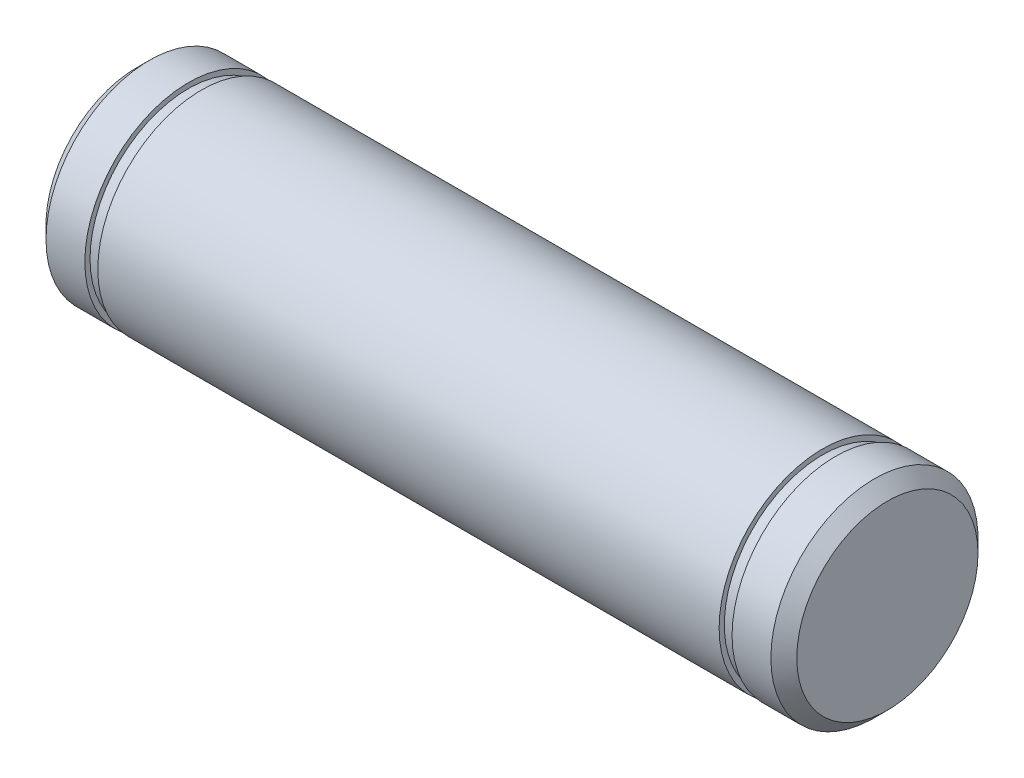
ISO-10303-21;
HEADER;
FILE_DESCRIPTION(('STEP AP214'),'2;1');
FILE_NAME('part.step','',(''),(''),'','','');
FILE_SCHEMA(('AUTOMOTIVE_DESIGN { 1 0 10303 214 1 1 1 1 }'));
ENDSEC;
DATA;
#1=APPLICATION_CONTEXT('core data for automotive mechanical design processes');
#2=APPLICATION_PROTOCOL_DEFINITION('international standard','automotive_design',2000,#1);
#3=PRODUCT_CONTEXT('',#1,'mechanical');
#4=PRODUCT('Part','Part','',(#3));
#5=PRODUCT_RELATED_PRODUCT_CATEGORY('part','',(#4));
#6=PRODUCT_DEFINITION_FORMATION('','',#4);
#7=PRODUCT_DEFINITION_CONTEXT('part definition',#1,'design');
#8=PRODUCT_DEFINITION('design','',#6,#7);
#9=PRODUCT_DEFINITION_SHAPE('','',#8);
#10=(LENGTH_UNIT() NAMED_UNIT(*) SI_UNIT(.MILLI.,.METRE.));
#11=(NAMED_UNIT(*) PLANE_ANGLE_UNIT() SI_UNIT($,.RADIAN.));
#12=(NAMED_UNIT(*) SI_UNIT($,.STERADIAN.) SOLID_ANGLE_UNIT());
#13=UNCERTAINTY_MEASURE_WITH_UNIT(LENGTH_MEASURE(1.E-05),#10,'distance_accuracy_value','');
#14=(GEOMETRIC_REPRESENTATION_CONTEXT(3) GLOBAL_UNCERTAINTY_ASSIGNED_CONTEXT((#13)) GLOBAL_UNIT_ASSIGNED_CONTEXT((#10,
#11,#12)) REPRESENTATION_CONTEXT('',''));
#15=CARTESIAN_POINT('',(0.,0.,0.));
#16=DIRECTION('',(0.,0.,1.));
#17=DIRECTION('',(1.,0.,0.));
#18=AXIS2_PLACEMENT_3D('',#15,#16,#17);
#19=CARTESIAN_POINT('',(14.5,0.,0.));
#20=DIRECTION('',(-1.,0.,0.));
#21=DIRECTION('',(0.,0.,1.));
#22=AXIS2_PLACEMENT_3D('',#19,#20,#21);
#23=CYLINDRICAL_SURFACE('',#22,2.);
#24=CARTESIAN_POINT('',(13.25,0.,0.));
#25=DIRECTION('',(1.,0.,0.));
#26=DIRECTION('',(0.,0.,-1.));
#27=AXIS2_PLACEMENT_3D('',#24,#25,#26);
#28=CIRCLE('',#27,2.);
#29=CARTESIAN_POINT('',(13.25,0.,2.));
#30=VERTEX_POINT('',#29);
#31=EDGE_CURVE('E54',#30,#30,#28,.T.);
#32=CARTESIAN_POINT('',(1.25,0.,0.));
#33=DIRECTION('',(-1.,0.,0.));
#34=DIRECTION('',(0.,0.,1.));
#35=AXIS2_PLACEMENT_3D('',#32,#33,#34);
#36=CIRCLE('',#35,2.);
#37=CARTESIAN_POINT('',(1.25,0.,2.));
#38=VERTEX_POINT('',#37);
#39=EDGE_CURVE('E55',#38,#38,#36,.T.);
#40=CARTESIAN_POINT('',(13.25,0.,2.));
#41=CARTESIAN_POINT('',(13.125,0.,2.));
#42=CARTESIAN_POINT('',(13.,0.,2.));
#43=CARTESIAN_POINT('',(12.75,0.,2.));
#44=CARTESIAN_POINT('',(12.625,0.,2.));
#45=CARTESIAN_POINT('',(12.375,0.,2.));
#46=CARTESIAN_POINT('',(12.25,0.,2.));
#47=CARTESIAN_POINT('',(12.,0.,2.));
#48=CARTESIAN_POINT('',(11.875,0.,2.));
#49=CARTESIAN_POINT('',(11.625,0.,2.));
#50=CARTESIAN_POINT('',(11.5,0.,2.));
#51=CARTESIAN_POINT('',(11.25,0.,2.));
#52=CARTESIAN_POINT('',(11.125,0.,2.));
#53=CARTESIAN_POINT('',(10.875,0.,2.));
#54=CARTESIAN_POINT('',(10.75,0.,2.));
#55=CARTESIAN_POINT('',(10.5,0.,2.));
#56=CARTESIAN_POINT('',(10.375,0.,2.));
#57=CARTESIAN_POINT('',(10.125,0.,2.));
#58=CARTESIAN_POINT('',(10.,0.,2.));
#59=CARTESIAN_POINT('',(9.75,0.,2.));
#60=CARTESIAN_POINT('',(9.625,0.,2.));
#61=CARTESIAN_POINT('',(9.375,0.,2.));
#62=CARTESIAN_POINT('',(9.25,0.,2.));
#63=CARTESIAN_POINT('',(9.,0.,2.));
#64=CARTESIAN_POINT('',(8.875,0.,2.));
#65=CARTESIAN_POINT('',(8.625,0.,2.));
#66=CARTESIAN_POINT('',(8.5,0.,2.));
#67=CARTESIAN_POINT('',(8.25,0.,2.));
#68=CARTESIAN_POINT('',(8.125,0.,2.));
#69=CARTESIAN_POINT('',(7.875,0.,2.));
#70=CARTESIAN_POINT('',(7.75,0.,2.));
#71=CARTESIAN_POINT('',(7.5,0.,2.));
#72=CARTESIAN_POINT('',(7.375,0.,2.));
#73=CARTESIAN_POINT('',(7.125,0.,2.));
#74=CARTESIAN_POINT('',(7.,0.,2.));
#75=CARTESIAN_POINT('',(6.75,0.,2.));
#76=CARTESIAN_POINT('',(6.625,0.,2.));
#77=CARTESIAN_POINT('',(6.375,0.,2.));
#78=CARTESIAN_POINT('',(6.25,0.,2.));
#79=CARTESIAN_POINT('',(6.,0.,2.));
#80=CARTESIAN_POINT('',(5.875,0.,2.));
#81=CARTESIAN_POINT('',(5.625,0.,2.));
#82=CARTESIAN_POINT('',(5.5,0.,2.));
#83=CARTESIAN_POINT('',(5.25,0.,2.));
#84=CARTESIAN_POINT('',(5.125,0.,2.));
#85=CARTESIAN_POINT('',(4.875,0.,2.));
#86=CARTESIAN_POINT('',(4.75,0.,2.));
#87=CARTESIAN_POINT('',(4.5,0.,2.));
#88=CARTESIAN_POINT('',(4.375,0.,2.));
#89=CARTESIAN_POINT('',(4.125,0.,2.));
#90=CARTESIAN_POINT('',(4.,0.,2.));
#91=CARTESIAN_POINT('',(3.75,0.,2.));
#92=CARTESIAN_POINT('',(3.625,0.,2.));
#93=CARTESIAN_POINT('',(3.375,0.,2.));
#94=CARTESIAN_POINT('',(3.25,0.,2.));
#95=CARTESIAN_POINT('',(3.,0.,2.));
#96=CARTESIAN_POINT('',(2.875,0.,2.));
#97=CARTESIAN_POINT('',(2.625,0.,2.));
#98=CARTESIAN_POINT('',(2.5,0.,2.));
#99=CARTESIAN_POINT('',(2.25,0.,2.));
#100=CARTESIAN_POINT('',(2.125,0.,2.));
#101=CARTESIAN_POINT('',(1.875,0.,2.));
#102=CARTESIAN_POINT('',(1.75,0.,2.));
#103=CARTESIAN_POINT('',(1.5,0.,2.));
#104=CARTESIAN_POINT('',(1.375,0.,2.));
#105=CARTESIAN_POINT('',(1.25,0.,2.));
#106=B_SPLINE_CURVE_WITH_KNOTS('',3,(#40,#41,#42,#43,#44,#45,#46,#47,#48,#49,#50,#51,#52,#53,
#54,#55,#56,#57,#58,#59,#60,#61,#62,#63,#64,#65,#66,#67,#68,#69,#70,#71,#72,#73,#74,#75,#76,#77,
#78,#79,#80,#81,#82,#83,#84,#85,#86,#87,#88,#89,#90,#91,#92,#93,#94,#95,#96,#97,#98,#99,#100,
#101,#102,#103,#104,#105),.UNSPECIFIED.,.F.,.F.,(4,2,2,2,2,2,2,2,2,2,2,2,2,2,2,2,2,2,2,2,2,2,2,
2,2,2,2,2,2,2,2,2,4),(0.,0.374999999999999,0.749999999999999,1.125,1.5,1.875,2.25,2.625,3.,
3.375,3.75,4.125,4.5,4.875,5.25,5.625,6.,6.375,6.75,7.125,7.5,7.875,8.25,8.625,9.,9.375,9.75,
10.125,10.5,10.875,11.25,11.625,12.),.UNSPECIFIED.);
#107=EDGE_CURVE('BSEAM34',#30,#38,#106,.T.);
#108=ORIENTED_EDGE('',*,*,#31,.F.);
#109=ORIENTED_EDGE('',*,*,#39,.F.);
#110=ORIENTED_EDGE('',*,*,#107,.T.);
#111=ORIENTED_EDGE('',*,*,#107,.F.);
#112=EDGE_LOOP('',(#108,#110,#109,#111));
#113=FACE_BOUND('',#112,.T.);
#114=ADVANCED_FACE('F34',(#113),#23,.T.);
#115=CARTESIAN_POINT('',(13.25,0.,0.));
#116=DIRECTION('',(1.,0.,0.));
#117=DIRECTION('',(0.,0.,-1.));
#118=AXIS2_PLACEMENT_3D('',#115,#116,#117);
#119=PLANE('',#118);
#120=CARTESIAN_POINT('',(13.25,0.,0.));
#121=DIRECTION('',(1.,0.,0.));
#122=DIRECTION('',(0.,0.,-1.));
#123=AXIS2_PLACEMENT_3D('',#120,#121,#122);
#124=CIRCLE('',#123,1.9);
#125=CARTESIAN_POINT('',(13.25,0.,-1.9));
#126=VERTEX_POINT('',#125);
#127=EDGE_CURVE('E68',#126,#126,#124,.T.);
#128=ORIENTED_EDGE('',*,*,#127,.F.);
#129=EDGE_LOOP('',(#128));
#130=FACE_BOUND('',#129,.T.);
#131=ORIENTED_EDGE('',*,*,#31,.T.);
#132=EDGE_LOOP('',(#131));
#133=FACE_BOUND('',#132,.T.);
#134=ADVANCED_FACE('F91',(#130,#133),#119,.T.);
#135=CARTESIAN_POINT('',(13.5,0.,0.));
#136=DIRECTION('',(1.,0.,0.));
#137=DIRECTION('',(0.,0.,-1.));
#138=AXIS2_PLACEMENT_3D('',#135,#136,#137);
#139=PLANE('',#138);
#140=CARTESIAN_POINT('',(13.5,0.,0.));
#141=DIRECTION('',(1.,0.,0.));
#142=DIRECTION('',(0.,0.,-1.));
#143=AXIS2_PLACEMENT_3D('',#140,#141,#142);
#144=CIRCLE('',#143,1.9);
#145=CARTESIAN_POINT('',(13.5,0.,-1.9));
#146=VERTEX_POINT('',#145);
#147=EDGE_CURVE('E58',#146,#146,#144,.T.);
#148=ORIENTED_EDGE('',*,*,#147,.T.);
#149=EDGE_LOOP('',(#148));
#150=FACE_BOUND('',#149,.T.);
#151=CARTESIAN_POINT('',(13.5,0.,0.));
#152=DIRECTION('',(1.,0.,0.));
#153=DIRECTION('',(0.,0.,-1.));
#154=AXIS2_PLACEMENT_3D('',#151,#152,#153);
#155=CIRCLE('',#154,2.);
#156=CARTESIAN_POINT('',(13.5,0.,2.));
#157=VERTEX_POINT('',#156);
#158=EDGE_CURVE('E65',#157,#157,#155,.T.);
#159=ORIENTED_EDGE('',*,*,#158,.F.);
#160=EDGE_LOOP('',(#159));
#161=FACE_BOUND('',#160,.T.);
#162=ADVANCED_FACE('F98',(#150,#161),#139,.F.);
#163=CARTESIAN_POINT('',(13.25,0.,0.));
#164=DIRECTION('',(1.,0.,0.));
#165=DIRECTION('',(0.,0.,-1.));
#166=AXIS2_PLACEMENT_3D('',#163,#164,#165);
#167=CYLINDRICAL_SURFACE('',#166,1.9);
#168=ORIENTED_EDGE('',*,*,#127,.T.);
#169=EDGE_LOOP('',(#168));
#170=FACE_BOUND('',#169,.T.);
#171=ORIENTED_EDGE('',*,*,#147,.F.);
#172=EDGE_LOOP('',(#171));
#173=FACE_BOUND('',#172,.T.);
#174=ADVANCED_FACE('F112',(#170,#173),#167,.T.);
#175=CARTESIAN_POINT('',(14.5,0.,0.));
#176=DIRECTION('',(1.,0.,0.));
#177=DIRECTION('',(0.,0.,-1.));
#178=AXIS2_PLACEMENT_3D('',#175,#176,#177);
#179=PLANE('',#178);
#180=CARTESIAN_POINT('',(14.5,0.,0.));
#181=DIRECTION('',(1.,0.,0.));
#182=DIRECTION('',(0.,0.,-1.));
#183=AXIS2_PLACEMENT_3D('',#180,#181,#182);
#184=CIRCLE('',#183,1.75000000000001);
#185=CARTESIAN_POINT('',(14.5,0.,-1.75000000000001));
#186=VERTEX_POINT('',#185);
#187=EDGE_CURVE('E49',#186,#186,#184,.T.);
#188=ORIENTED_EDGE('',*,*,#187,.T.);
#189=EDGE_LOOP('',(#188));
#190=FACE_BOUND('',#189,.T.);
#191=ADVANCED_FACE('F107',(#190),#179,.T.);
#192=CARTESIAN_POINT('',(14.25,0.,0.));
#193=DIRECTION('',(1.,0.,0.));
#194=DIRECTION('',(0.,0.,-1.));
#195=AXIS2_PLACEMENT_3D('',#192,#193,#194);
#196=CIRCLE('',#195,2.);
#197=CARTESIAN_POINT('',(14.25,0.,2.));
#198=VERTEX_POINT('',#197);
#199=EDGE_CURVE('E45',#198,#198,#196,.F.);
#200=CARTESIAN_POINT('',(14.25,0.,2.));
#201=CARTESIAN_POINT('',(14.2421875,0.,2.));
#202=CARTESIAN_POINT('',(14.234375,0.,2.));
#203=CARTESIAN_POINT('',(14.21875,0.,2.));
#204=CARTESIAN_POINT('',(14.2109375,0.,2.));
#205=CARTESIAN_POINT('',(14.1953125,0.,2.));
#206=CARTESIAN_POINT('',(14.1875,0.,2.));
#207=CARTESIAN_POINT('',(14.171875,0.,2.));
#208=CARTESIAN_POINT('',(14.1640625,0.,2.));
#209=CARTESIAN_POINT('',(14.1484375,0.,2.));
#210=CARTESIAN_POINT('',(14.140625,0.,2.));
#211=CARTESIAN_POINT('',(14.125,0.,2.));
#212=CARTESIAN_POINT('',(14.1171875,0.,2.));
#213=CARTESIAN_POINT('',(14.1015625,0.,2.));
#214=CARTESIAN_POINT('',(14.09375,0.,2.));
#215=CARTESIAN_POINT('',(14.078125,0.,2.));
#216=CARTESIAN_POINT('',(14.0703125,0.,2.));
#217=CARTESIAN_POINT('',(14.0546875,0.,2.));
#218=CARTESIAN_POINT('',(14.046875,0.,2.));
#219=CARTESIAN_POINT('',(14.03125,0.,2.));
#220=CARTESIAN_POINT('',(14.0234375,0.,2.));
#221=CARTESIAN_POINT('',(14.0078125,0.,2.));
#222=CARTESIAN_POINT('',(14.,0.,2.));
#223=CARTESIAN_POINT('',(13.984375,0.,2.));
#224=CARTESIAN_POINT('',(13.9765625,0.,2.));
#225=CARTESIAN_POINT('',(13.9609375,0.,2.));
#226=CARTESIAN_POINT('',(13.953125,0.,2.));
#227=CARTESIAN_POINT('',(13.9375,0.,2.));
#228=CARTESIAN_POINT('',(13.9296875,0.,2.));
#229=CARTESIAN_POINT('',(13.9140625,0.,2.));
#230=CARTESIAN_POINT('',(13.90625,0.,2.));
#231=CARTESIAN_POINT('',(13.890625,0.,2.));
#232=CARTESIAN_POINT('',(13.8828125,0.,2.));
#233=CARTESIAN_POINT('',(13.8671875,0.,2.));
#234=CARTESIAN_POINT('',(13.859375,0.,2.));
#235=CARTESIAN_POINT('',(13.84375,0.,2.));
#236=CARTESIAN_POINT('',(13.8359375,0.,2.));
#237=CARTESIAN_POINT('',(13.8203125,0.,2.));
#238=CARTESIAN_POINT('',(13.8125,0.,2.));
#239=CARTESIAN_POINT('',(13.796875,0.,2.));
#240=CARTESIAN_POINT('',(13.7890625,0.,2.));
#241=CARTESIAN_POINT('',(13.7734375,0.,2.));
#242=CARTESIAN_POINT('',(13.765625,0.,2.));
#243=CARTESIAN_POINT('',(13.75,0.,2.));
#244=CARTESIAN_POINT('',(13.7421875,0.,2.));
#245=CARTESIAN_POINT('',(13.7265625,0.,2.));
#246=CARTESIAN_POINT('',(13.71875,0.,2.));
#247=CARTESIAN_POINT('',(13.703125,0.,2.));
#248=CARTESIAN_POINT('',(13.6953125,0.,2.));
#249=CARTESIAN_POINT('',(13.6796875,0.,2.));
#250=CARTESIAN_POINT('',(13.671875,0.,2.));
#251=CARTESIAN_POINT('',(13.65625,0.,2.));
#252=CARTESIAN_POINT('',(13.6484375,0.,2.));
#253=CARTESIAN_POINT('',(13.6328125,0.,2.));
#254=CARTESIAN_POINT('',(13.625,0.,2.));
#255=CARTESIAN_POINT('',(13.609375,0.,2.));
#256=CARTESIAN_POINT('',(13.6015625,0.,2.));
#257=CARTESIAN_POINT('',(13.5859375,0.,2.));
#258=CARTESIAN_POINT('',(13.578125,0.,2.));
#259=CARTESIAN_POINT('',(13.5625,0.,2.));
#260=CARTESIAN_POINT('',(13.5546875,0.,2.));
#261=CARTESIAN_POINT('',(13.5390625,0.,2.));
#262=CARTESIAN_POINT('',(13.53125,0.,2.));
#263=CARTESIAN_POINT('',(13.515625,0.,2.));
#264=CARTESIAN_POINT('',(13.5078125,0.,2.));
#265=CARTESIAN_POINT('',(13.5,0.,2.));
#266=B_SPLINE_CURVE_WITH_KNOTS('',3,(#200,#201,#202,#203,#204,#205,#206,#207,#208,#209,#210,
#211,#212,#213,#214,#215,#216,#217,#218,#219,#220,#221,#222,#223,#224,#225,#226,#227,#228,#229,
#230,#231,#232,#233,#234,#235,#236,#237,#238,#239,#240,#241,#242,#243,#244,#245,#246,#247,#248,
#249,#250,#251,#252,#253,#254,#255,#256,#257,#258,#259,#260,#261,#262,#263,#264,#265),
.UNSPECIFIED.,.F.,.F.,(4,2,2,2,2,2,2,2,2,2,2,2,2,2,2,2,2,2,2,2,2,2,2,2,2,2,2,2,2,2,2,2,4),(0.,
0.0234374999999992,0.046875,0.0703124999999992,0.0937500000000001,0.117187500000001,0.140625,
0.164062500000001,0.187500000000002,0.210937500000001,0.234375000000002,0.257812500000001,
0.281250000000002,0.304687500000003,0.328125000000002,0.351562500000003,0.375000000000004,
0.398437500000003,0.421875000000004,0.445312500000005,0.468750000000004,0.492187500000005,
0.515625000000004,0.539062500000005,0.562500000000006,0.585937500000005,0.609375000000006,
0.632812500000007,0.656250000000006,0.679687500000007,0.703125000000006,0.726562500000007,
0.750000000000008),.UNSPECIFIED.);
#267=EDGE_CURVE('BSEAM86',#198,#157,#266,.T.);
#268=ORIENTED_EDGE('',*,*,#199,.T.);
#269=ORIENTED_EDGE('',*,*,#158,.T.);
#270=ORIENTED_EDGE('',*,*,#267,.T.);
#271=ORIENTED_EDGE('',*,*,#267,.F.);
#272=EDGE_LOOP('',(#268,#270,#269,#271));
#273=FACE_BOUND('',#272,.T.);
#274=ADVANCED_FACE('F86',(#273),#23,.T.);
#275=CARTESIAN_POINT('',(1.25,0.,0.));
#276=DIRECTION('',(-1.,0.,0.));
#277=DIRECTION('',(0.,0.,1.));
#278=AXIS2_PLACEMENT_3D('',#275,#276,#277);
#279=PLANE('',#278);
#280=CARTESIAN_POINT('',(1.25,0.,0.));
#281=DIRECTION('',(-1.,0.,0.));
#282=DIRECTION('',(0.,0.,1.));
#283=AXIS2_PLACEMENT_3D('',#280,#281,#282);
#284=CIRCLE('',#283,1.9);
#285=CARTESIAN_POINT('',(1.25,0.,1.9));
#286=VERTEX_POINT('',#285);
#287=EDGE_CURVE('E62',#286,#286,#284,.T.);
#288=ORIENTED_EDGE('',*,*,#287,.F.);
#289=EDGE_LOOP('',(#288));
#290=FACE_BOUND('',#289,.T.);
#291=ORIENTED_EDGE('',*,*,#39,.T.);
#292=EDGE_LOOP('',(#291));
#293=FACE_BOUND('',#292,.T.);
#294=ADVANCED_FACE('F82',(#290,#293),#279,.T.);
#295=CARTESIAN_POINT('',(1.,0.,0.));
#296=DIRECTION('',(-1.,0.,0.));
#297=DIRECTION('',(0.,0.,1.));
#298=AXIS2_PLACEMENT_3D('',#295,#296,#297);
#299=PLANE('',#298);
#300=CARTESIAN_POINT('',(1.,0.,0.));
#301=DIRECTION('',(-1.,0.,0.));
#302=DIRECTION('',(0.,0.,1.));
#303=AXIS2_PLACEMENT_3D('',#300,#301,#302);
#304=CIRCLE('',#303,1.9);
#305=CARTESIAN_POINT('',(1.,0.,1.9));
#306=VERTEX_POINT('',#305);
#307=EDGE_CURVE('E73',#306,#306,#304,.T.);
#308=ORIENTED_EDGE('',*,*,#307,.T.);
#309=EDGE_LOOP('',(#308));
#310=FACE_BOUND('',#309,.T.);
#311=CARTESIAN_POINT('',(0.999999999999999,0.,0.));
#312=DIRECTION('',(-1.,0.,0.));
#313=DIRECTION('',(0.,0.,1.));
#314=AXIS2_PLACEMENT_3D('',#311,#312,#313);
#315=CIRCLE('',#314,2.);
#316=CARTESIAN_POINT('',(1.,0.,2.));
#317=VERTEX_POINT('',#316);
#318=EDGE_CURVE('E59',#317,#317,#315,.T.);
#319=ORIENTED_EDGE('',*,*,#318,.F.);
#320=EDGE_LOOP('',(#319));
#321=FACE_BOUND('',#320,.T.);
#322=ADVANCED_FACE('F85',(#310,#321),#299,.F.);
#323=CARTESIAN_POINT('',(1.25,0.,0.));
#324=DIRECTION('',(-1.,0.,0.));
#325=DIRECTION('',(0.,0.,1.));
#326=AXIS2_PLACEMENT_3D('',#323,#324,#325);
#327=CYLINDRICAL_SURFACE('',#326,1.9);
#328=ORIENTED_EDGE('',*,*,#287,.T.);
#329=EDGE_LOOP('',(#328));
#330=FACE_BOUND('',#329,.T.);
#331=ORIENTED_EDGE('',*,*,#307,.F.);
#332=EDGE_LOOP('',(#331));
#333=FACE_BOUND('',#332,.T.);
#334=ADVANCED_FACE('F79',(#330,#333),#327,.T.);
#335=CARTESIAN_POINT('',(0.,0.,0.));
#336=DIRECTION('',(1.,0.,0.));
#337=DIRECTION('',(0.,0.,-1.));
#338=AXIS2_PLACEMENT_3D('',#335,#336,#337);
#339=PLANE('',#338);
#340=CARTESIAN_POINT('',(0.,0.,0.));
#341=DIRECTION('',(1.,0.,0.));
#342=DIRECTION('',(0.,0.,-1.));
#343=AXIS2_PLACEMENT_3D('',#340,#341,#342);
#344=CIRCLE('',#343,1.74999999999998);
#345=CARTESIAN_POINT('',(0.,0.,-1.74999999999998));
#346=VERTEX_POINT('',#345);
#347=EDGE_CURVE('E10',#346,#346,#344,.F.);
#348=ORIENTED_EDGE('',*,*,#347,.T.);
#349=EDGE_LOOP('',(#348));
#350=FACE_BOUND('',#349,.T.);
#351=ADVANCED_FACE('F105',(#350),#339,.F.);
#352=CARTESIAN_POINT('',(0.250000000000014,0.,0.));
#353=DIRECTION('',(1.,0.,0.));
#354=DIRECTION('',(0.,0.,-1.));
#355=AXIS2_PLACEMENT_3D('',#352,#353,#354);
#356=CIRCLE('',#355,2.);
#357=CARTESIAN_POINT('',(0.250000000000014,0.,2.));
#358=VERTEX_POINT('',#357);
#359=EDGE_CURVE('E41',#358,#358,#356,.T.);
#360=CARTESIAN_POINT('',(0.250000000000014,0.,2.));
#361=CARTESIAN_POINT('',(0.257812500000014,0.,2.));
#362=CARTESIAN_POINT('',(0.265625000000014,0.,2.));
#363=CARTESIAN_POINT('',(0.281250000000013,0.,2.));
#364=CARTESIAN_POINT('',(0.289062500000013,0.,2.));
#365=CARTESIAN_POINT('',(0.304687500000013,0.,2.));
#366=CARTESIAN_POINT('',(0.312500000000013,0.,2.));
#367=CARTESIAN_POINT('',(0.328125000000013,0.,2.));
#368=CARTESIAN_POINT('',(0.335937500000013,0.,2.));
#369=CARTESIAN_POINT('',(0.351562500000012,0.,2.));
#370=CARTESIAN_POINT('',(0.359375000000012,0.,2.));
#371=CARTESIAN_POINT('',(0.375000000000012,0.,2.));
#372=CARTESIAN_POINT('',(0.382812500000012,0.,2.));
#373=CARTESIAN_POINT('',(0.398437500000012,0.,2.));
#374=CARTESIAN_POINT('',(0.406250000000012,0.,2.));
#375=CARTESIAN_POINT('',(0.421875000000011,0.,2.));
#376=CARTESIAN_POINT('',(0.429687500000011,0.,2.));
#377=CARTESIAN_POINT('',(0.445312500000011,0.,2.));
#378=CARTESIAN_POINT('',(0.45312500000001,0.,2.));
#379=CARTESIAN_POINT('',(0.46875000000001,0.,2.));
#380=CARTESIAN_POINT('',(0.476562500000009,0.,2.));
#381=CARTESIAN_POINT('',(0.492187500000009,0.,2.));
#382=CARTESIAN_POINT('',(0.50000000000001,0.,2.));
#383=CARTESIAN_POINT('',(0.51562500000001,0.,2.));
#384=CARTESIAN_POINT('',(0.523437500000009,0.,2.));
#385=CARTESIAN_POINT('',(0.539062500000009,0.,2.));
#386=CARTESIAN_POINT('',(0.546875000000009,0.,2.));
#387=CARTESIAN_POINT('',(0.562500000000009,0.,2.));
#388=CARTESIAN_POINT('',(0.570312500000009,0.,2.));
#389=CARTESIAN_POINT('',(0.585937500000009,0.,2.));
#390=CARTESIAN_POINT('',(0.593750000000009,0.,2.));
#391=CARTESIAN_POINT('',(0.609375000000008,0.,2.));
#392=CARTESIAN_POINT('',(0.617187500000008,0.,2.));
#393=CARTESIAN_POINT('',(0.632812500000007,0.,2.));
#394=CARTESIAN_POINT('',(0.640625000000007,0.,2.));
#395=CARTESIAN_POINT('',(0.656250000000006,0.,2.));
#396=CARTESIAN_POINT('',(0.664062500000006,0.,2.));
#397=CARTESIAN_POINT('',(0.679687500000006,0.,2.));
#398=CARTESIAN_POINT('',(0.687500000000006,0.,2.));
#399=CARTESIAN_POINT('',(0.703125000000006,0.,2.));
#400=CARTESIAN_POINT('',(0.710937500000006,0.,2.));
#401=CARTESIAN_POINT('',(0.726562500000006,0.,2.));
#402=CARTESIAN_POINT('',(0.734375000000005,0.,2.));
#403=CARTESIAN_POINT('',(0.750000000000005,0.,2.));
#404=CARTESIAN_POINT('',(0.757812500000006,0.,2.));
#405=CARTESIAN_POINT('',(0.773437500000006,0.,2.));
#406=CARTESIAN_POINT('',(0.781250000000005,0.,2.));
#407=CARTESIAN_POINT('',(0.796875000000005,0.,2.));
#408=CARTESIAN_POINT('',(0.804687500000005,0.,2.));
#409=CARTESIAN_POINT('',(0.820312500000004,0.,2.));
#410=CARTESIAN_POINT('',(0.828125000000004,0.,2.));
#411=CARTESIAN_POINT('',(0.843750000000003,0.,2.));
#412=CARTESIAN_POINT('',(0.851562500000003,0.,2.));
#413=CARTESIAN_POINT('',(0.867187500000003,0.,2.));
#414=CARTESIAN_POINT('',(0.875000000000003,0.,2.));
#415=CARTESIAN_POINT('',(0.890625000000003,0.,2.));
#416=CARTESIAN_POINT('',(0.898437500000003,0.,2.));
#417=CARTESIAN_POINT('',(0.914062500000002,0.,2.));
#418=CARTESIAN_POINT('',(0.921875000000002,0.,2.));
#419=CARTESIAN_POINT('',(0.937500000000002,0.,2.));
#420=CARTESIAN_POINT('',(0.945312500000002,0.,2.));
#421=CARTESIAN_POINT('',(0.960937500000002,0.,2.));
#422=CARTESIAN_POINT('',(0.968750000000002,0.,2.));
#423=CARTESIAN_POINT('',(0.984375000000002,0.,2.));
#424=CARTESIAN_POINT('',(0.992187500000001,0.,2.));
#425=CARTESIAN_POINT('',(1.,0.,2.));
#426=B_SPLINE_CURVE_WITH_KNOTS('',3,(#360,#361,#362,#363,#364,#365,#366,#367,#368,#369,#370,
#371,#372,#373,#374,#375,#376,#377,#378,#379,#380,#381,#382,#383,#384,#385,#386,#387,#388,#389,
#390,#391,#392,#393,#394,#395,#396,#397,#398,#399,#400,#401,#402,#403,#404,#405,#406,#407,#408,
#409,#410,#411,#412,#413,#414,#415,#416,#417,#418,#419,#420,#421,#422,#423,#424,#425),
.UNSPECIFIED.,.F.,.F.,(4,2,2,2,2,2,2,2,2,2,2,2,2,2,2,2,2,2,2,2,2,2,2,2,2,2,2,2,2,2,2,2,4),(0.,
0.0234374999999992,0.0468749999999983,0.0703124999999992,0.0937499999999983,0.117187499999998,
0.140624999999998,0.164062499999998,0.187499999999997,0.210937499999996,0.234374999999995,
0.257812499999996,0.281249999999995,0.304687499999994,0.328124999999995,0.351562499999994,
0.374999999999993,0.398437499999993,0.421874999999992,0.445312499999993,0.468749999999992,
0.492187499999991,0.515624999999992,0.539062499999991,0.56249999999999,0.585937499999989,
0.609374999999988,0.632812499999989,0.656249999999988,0.679687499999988,0.703124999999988,
0.726562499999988,0.749999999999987),.UNSPECIFIED.);
#427=EDGE_CURVE('BSEAM94',#358,#317,#426,.T.);
#428=ORIENTED_EDGE('',*,*,#359,.T.);
#429=ORIENTED_EDGE('',*,*,#318,.T.);
#430=ORIENTED_EDGE('',*,*,#427,.T.);
#431=ORIENTED_EDGE('',*,*,#427,.F.);
#432=EDGE_LOOP('',(#428,#430,#429,#431));
#433=FACE_BOUND('',#432,.T.);
#434=ADVANCED_FACE('F94',(#433),#23,.T.);
#435=CARTESIAN_POINT('',(14.5,0.,0.));
#436=DIRECTION('',(-1.,0.,0.));
#437=DIRECTION('',(0.,0.,1.));
#438=AXIS2_PLACEMENT_3D('',#435,#436,#437);
#439=CONICAL_SURFACE('',#438,1.75000000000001,0.785398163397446);
#440=ORIENTED_EDGE('',*,*,#199,.F.);
#441=EDGE_LOOP('',(#440));
#442=FACE_BOUND('',#441,.T.);
#443=ORIENTED_EDGE('',*,*,#187,.F.);
#444=EDGE_LOOP('',(#443));
#445=FACE_BOUND('',#444,.T.);
#446=ADVANCED_FACE('F104',(#442,#445),#439,.T.);
#447=CARTESIAN_POINT('',(0.250000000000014,0.,0.));
#448=DIRECTION('',(1.,0.,0.));
#449=DIRECTION('',(0.,0.,-1.));
#450=AXIS2_PLACEMENT_3D('',#447,#448,#449);
#451=CONICAL_SURFACE('',#450,2.,0.785398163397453);
#452=ORIENTED_EDGE('',*,*,#347,.F.);
#453=EDGE_LOOP('',(#452));
#454=FACE_BOUND('',#453,.T.);
#455=ORIENTED_EDGE('',*,*,#359,.F.);
#456=EDGE_LOOP('',(#455));
#457=FACE_BOUND('',#456,.T.);
#458=ADVANCED_FACE('F36',(#454,#457),#451,.T.);
#459=CLOSED_SHELL('',(#114,#134,#162,#174,#191,#274,#294,#322,#334,#351,#434,#446,#458));
#460=MANIFOLD_SOLID_BREP('B2',#459);
#461=ADVANCED_BREP_SHAPE_REPRESENTATION('',(#18,#460),#14);
#462=SHAPE_DEFINITION_REPRESENTATION(#9,#461);
ENDSEC;
END-ISO-10303-21;
